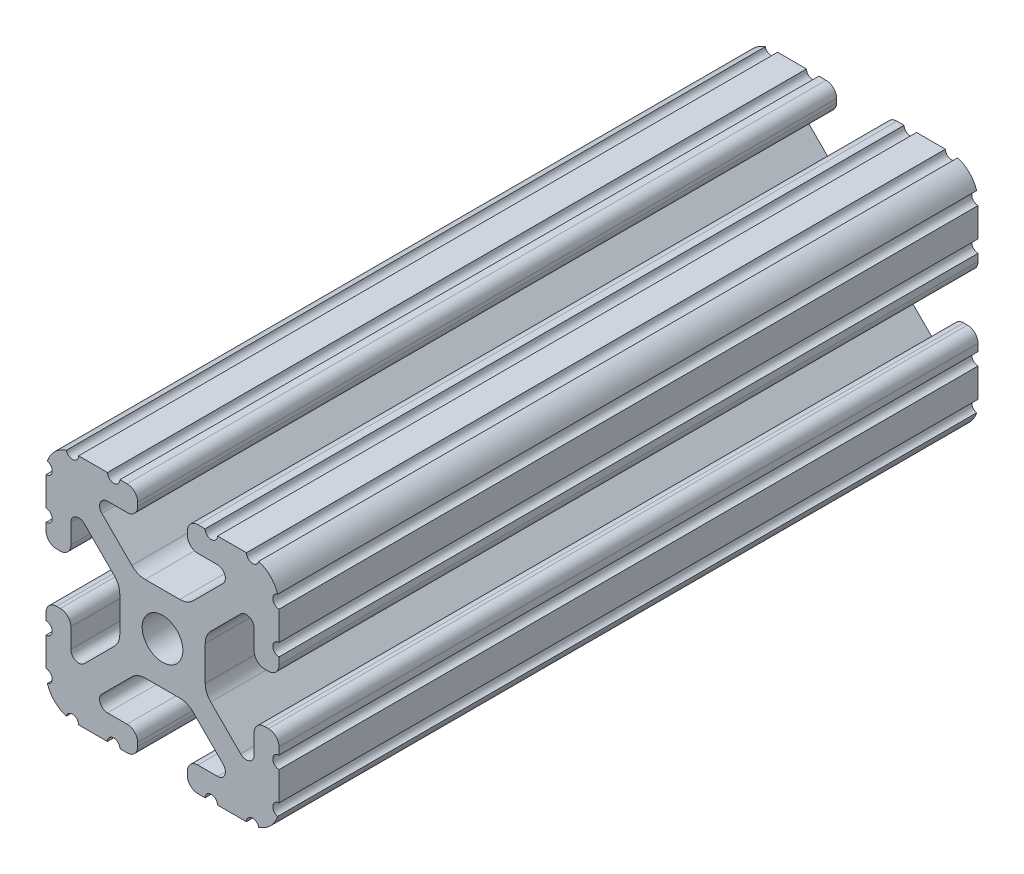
from build123d import *

# Parameters (mm, degrees)
BOSS_EXTRUDE1_DEPTH     = 457.2
CUT_EXTRUDE1_DEPTH      = 458.993062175
CUT_EXTRUDE1_DEPTH_BACK = 458.993062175
SKETCH5_R               = 1.016
SKETCH6_W               = 39.134581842
SKETCH6_H               = 38.977379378
CUT_EXTRUDE2_DEPTH      = 800.1


with BuildPart() as part:
    # Sketch4 → Boss-Extrude1 (new, symmetric)
    with BuildSketch(Plane.XY):
        with BuildLine():
            Line((5.7912, -19.05), (14.3002, -19.05))
            ThreePointArc((14.3002, -19.05), (17.658815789, -17.658815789), (19.05, -14.3002))
            Line((19.05, -14.3002), (19.05, -5.7912))
            ThreePointArc((19.05, -5.7912), (18.544114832, -4.569885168), (17.3228, -4.064))
            Line((17.3228, -4.064), (16.7132, -4.064))
            ThreePointArc((16.7132, -4.064), (15.491885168, -4.569885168), (14.986, -5.7912))
            Line((14.986, -5.7912), (14.986, -8.996305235))
            ThreePointArc((14.986, -8.996305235), (14.189232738, -10.188751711), (12.782646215, -9.908964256))
            Line((12.782646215, -9.908964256), (7.888897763, -5.015215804))
            ThreePointArc((7.888897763, -5.015215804), (7.219915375, -4.014012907), (6.985, -2.833013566))
            Line((6.985, -2.833013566), (6.985, 0))
            Line((6.985, 0), (3.3274, 0))
            ThreePointArc((3.3274, 0), (2.352827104, -2.352827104), (0, -3.3274))
            Line((0, -3.3274), (0, -6.985))
            Line((0, -6.985), (2.833013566, -6.985))
            ThreePointArc((2.833013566, -6.985), (4.014012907, -7.219915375), (5.015215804, -7.888897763))
            Line((5.015215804, -7.888897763), (9.908964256, -12.782646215))
            ThreePointArc((9.908964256, -12.782646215), (10.188751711, -14.189232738), (8.996305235, -14.986))
            Line((8.996305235, -14.986), (5.7912, -14.986))
            ThreePointArc((5.7912, -14.986), (4.569885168, -15.491885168), (4.064, -16.7132))
            Line((4.064, -16.7132), (4.064, -17.3228))
            ThreePointArc((4.064, -17.3228), (4.569885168, -18.544114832), (5.7912, -19.05))
        make_face()
    extrude(amount=BOSS_EXTRUDE1_DEPTH, both=True)

    # Sketch5 → Cut-Extrude1 (cut, two sides: drawn at the far end of the back side and taken through both)
    with BuildSketch(Plane.XY.offset(-CUT_EXTRUDE1_DEPTH_BACK)):
        with Locations((14.739477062, -19.05)):
            Circle(SKETCH5_R)
        with Locations((7.980305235, -19.05)):
            Circle(SKETCH5_R)
        with Locations((19.05, -14.739477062)):
            Circle(SKETCH5_R)
        with Locations((19.05, -7.980305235)):
            Circle(SKETCH5_R)
    extrude(amount=CUT_EXTRUDE1_DEPTH + CUT_EXTRUDE1_DEPTH_BACK, mode=Mode.SUBTRACT)

    # Mirror1: part across plane


with BuildPart() as part_1:
    add(part.part)
    add(part.part.mirror(Plane(origin=(0, 0, 0), x_dir=(0, 0, 1), z_dir=(1, 0, 0))))

    # Mirror2: part across plane


with BuildPart() as part_2:
    add(part_1.part)
    add(part_1.part.mirror(Plane.ZX))

    # Sketch6 → Cut-Extrude2 (cut)
    with BuildSketch(Plane.XY.offset(457.2)):
        Rectangle(SKETCH6_W, SKETCH6_H)
    extrude(amount=-CUT_EXTRUDE2_DEPTH, mode=Mode.SUBTRACT)


solid = part_2.part
